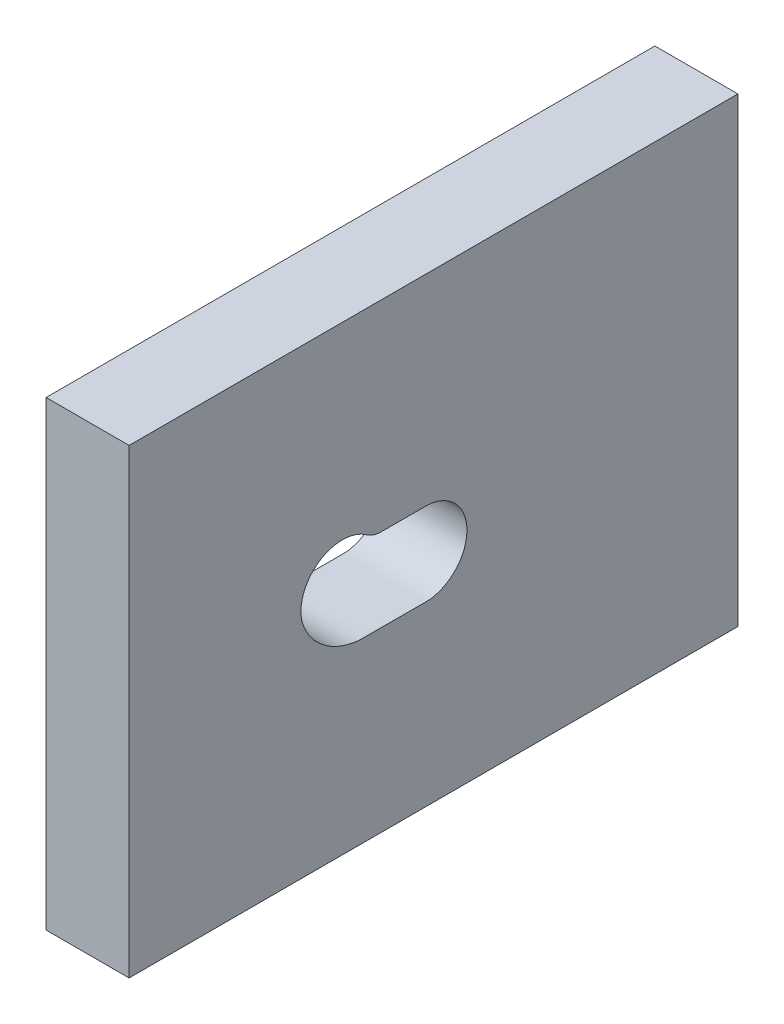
from build123d import *

# Parameters (mm, degrees)
SKETCH1_W      = 146.672646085
SKETCH1_H      = 111.127345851
EXTRUDE1_DEPTH = 20


with BuildPart() as part:
    # Sketch1 → Extrude1 (new body)
    with BuildSketch(Plane(origin=(0, 0, 0), x_dir=(0, 0, -1), z_dir=(1, 0, 0))):
        with Locations((12.614494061, 2.836685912)):
            Rectangle(SKETCH1_W, SKETCH1_H)
        with BuildLine():
            add(Edge.make_bspline(
                [(13.376526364, 9.627507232), (24.510366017, 6.500545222), (25.103469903, -5.0488489), (14.348517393, -9.29988093), (13.961851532, -9.452715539), (13.169456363, -9.71015495), (11.919946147, -10), (11.088396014, -10), (10.672620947, -10), (10.265048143, -10), (9.449902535, -10), (8.227184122, -10), (7.412038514, -10), (7.00446571, -10), (4.559028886, -10), (2.113592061, -10), (-0.331844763, -10), (-0.739417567, -10), (-1.554563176, -10), (-2.777281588, -10), (-3.592427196, -10), (-4, -10), (-4.461173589, -10), (-5.383520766, -10), (-6.768240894, -9.782164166), (-7.670398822, -9.586253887), (-8.116492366, -9.46928539), (-10.830241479, -8.757723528), (-13.274777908, -7.381134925), (-15.290232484, -5.429546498), (-16.134820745, -4.611721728), (-17.646276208, -2.792535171), (-19.310019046, 0.840061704), (-19.393709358, 3.226187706), (-19.230243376, 4.390423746), (-18.13893687, 12.162917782), (-11.078479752, 15.591118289), (-4.295695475, 11.641884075), (-4.114877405, 11.536603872), (-3.759849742, 11.314693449), (-3.250762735, 10.943879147), (-2.886910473, 10.736016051), (-2.700059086, 10.641858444), (-2.142015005, 10.360650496), (-1.54713471, 10.16931691), (-0.929790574, 10.072480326), (-0.827418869, 10.056422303), (-0.621843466, 10.029610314), (-0.310870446, 10), (-0.103623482, 10), (0, 10), (0.103623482, 10), (0.310870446, 10), (0.621740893, 10), (0.828987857, 10), (0.932611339, 10), (3.289896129, 10), (5.64718092, 10), (8.00446571, 10), (8.300927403, 10), (8.893850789, 10), (9.783235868, 10), (10.376159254, 10), (10.672620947, 10), (10.975892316, 10), (11.582435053, 10), (12.493141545, 9.846948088), (13.084551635, 9.709508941), (13.376526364, 9.627507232)],
                knots=[0, 0, 0, 0, 0.199475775, 0.199475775, 0.199475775, 0.212604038, 0.2257323, 0.238860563, 0.238860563, 0.238860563, 0.251729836, 0.264599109, 0.277468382, 0.277468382, 0.277468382, 0.354684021, 0.354684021, 0.354684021, 0.367553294, 0.380422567, 0.39329184, 0.39329184, 0.39329184, 0.407853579, 0.422415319, 0.436977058, 0.436977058, 0.436977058, 0.523630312, 0.523630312, 0.523630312, 0.560752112, 0.597873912, 0.634995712, 0.634995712, 0.634995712, 0.809733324, 0.809733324, 0.809733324, 0.816339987, 0.822946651, 0.829553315, 0.829553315, 0.829553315, 0.849125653, 0.849125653, 0.849125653, 0.852397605, 0.855669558, 0.858941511, 0.858941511, 0.858941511, 0.862213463, 0.865485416, 0.868757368, 0.868757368, 0.868757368, 0.943189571, 0.943189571, 0.943189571, 0.952550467, 0.961911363, 0.971272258, 0.971272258, 0.971272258, 0.980848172, 0.990424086, 1, 1, 1, 1], degree=3, weights=[1, 0.546273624, 0.546273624, 1, 1, 1, 1, 1, 1, 1, 1, 1, 1, 1, 1, 1, 1, 1, 1, 1, 1, 1, 1, 1, 1, 1, 1, 0.978200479, 0.978200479, 1, 1, 1, 1, 1, 1, 0.705079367, 0.705079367, 1, 1, 1, 1, 1, 1, 0.99194663, 0.99194663, 1, 1, 1, 1, 1, 1, 1, 1, 1, 1, 1, 1, 1, 1, 1, 1, 1, 1, 1, 1, 1, 1, 1, 1]))
        make_face(mode=Mode.SUBTRACT)
    extrude(amount=EXTRUDE1_DEPTH)


solid = part.part
